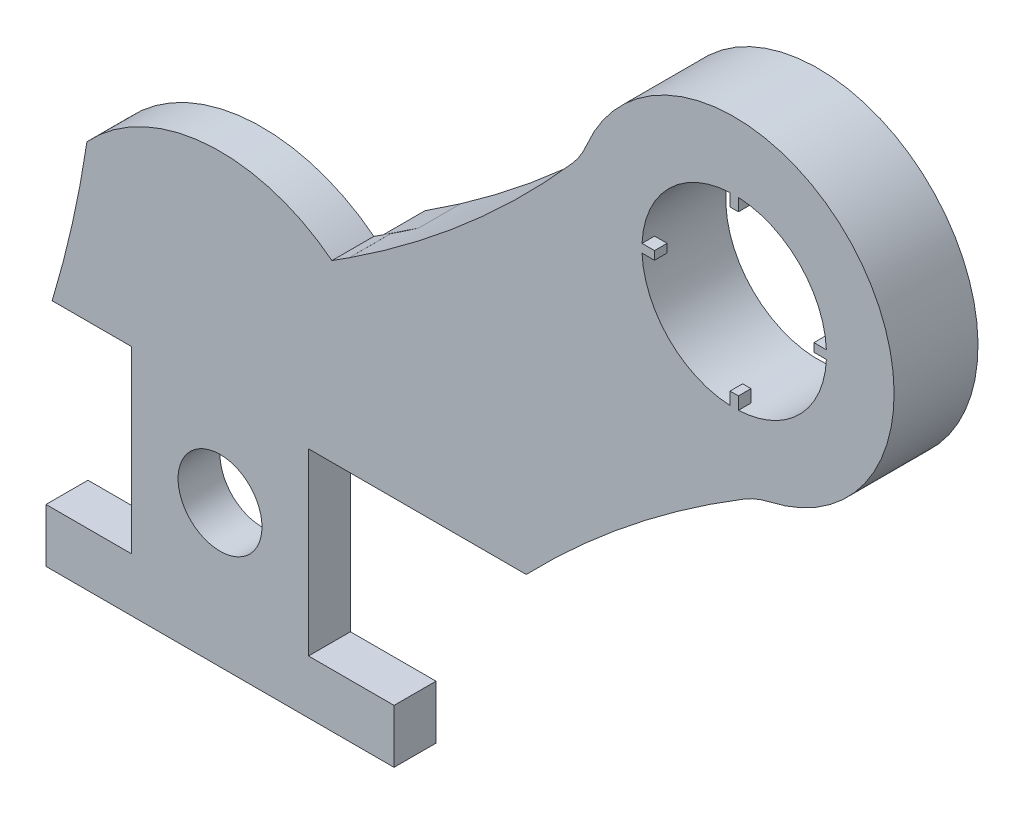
ISO-10303-21;
HEADER;
FILE_DESCRIPTION(('STEP AP214'),'2;1');
FILE_NAME('part.step','',(''),(''),'','','');
FILE_SCHEMA(('AUTOMOTIVE_DESIGN { 1 0 10303 214 1 1 1 1 }'));
ENDSEC;
DATA;
#1=APPLICATION_CONTEXT('core data for automotive mechanical design processes');
#2=APPLICATION_PROTOCOL_DEFINITION('international standard','automotive_design',2000,#1);
#3=PRODUCT_CONTEXT('',#1,'mechanical');
#4=PRODUCT('Part','Part','',(#3));
#5=PRODUCT_RELATED_PRODUCT_CATEGORY('part','',(#4));
#6=PRODUCT_DEFINITION_FORMATION('','',#4);
#7=PRODUCT_DEFINITION_CONTEXT('part definition',#1,'design');
#8=PRODUCT_DEFINITION('design','',#6,#7);
#9=PRODUCT_DEFINITION_SHAPE('','',#8);
#10=(LENGTH_UNIT() NAMED_UNIT(*) SI_UNIT(.MILLI.,.METRE.));
#11=(NAMED_UNIT(*) PLANE_ANGLE_UNIT() SI_UNIT($,.RADIAN.));
#12=(NAMED_UNIT(*) SI_UNIT($,.STERADIAN.) SOLID_ANGLE_UNIT());
#13=UNCERTAINTY_MEASURE_WITH_UNIT(LENGTH_MEASURE(1.E-05),#10,'distance_accuracy_value','');
#14=(GEOMETRIC_REPRESENTATION_CONTEXT(3) GLOBAL_UNCERTAINTY_ASSIGNED_CONTEXT((#13)) GLOBAL_UNIT_ASSIGNED_CONTEXT((#10,
#11,#12)) REPRESENTATION_CONTEXT('',''));
#15=CARTESIAN_POINT('',(0.,0.,0.));
#16=DIRECTION('',(0.,0.,1.));
#17=DIRECTION('',(1.,0.,0.));
#18=AXIS2_PLACEMENT_3D('',#15,#16,#17);
#19=CARTESIAN_POINT('',(61.2835554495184,51.423008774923,0.));
#20=DIRECTION('',(0.,0.,1.));
#21=DIRECTION('',(0.642787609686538,-0.766044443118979,0.));
#22=AXIS2_PLACEMENT_3D('',#19,#20,#21);
#23=CYLINDRICAL_SURFACE('',#22,11.);
#24=CARTESIAN_POINT('',(61.2835554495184,51.423008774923,0.));
#25=DIRECTION('',(0.,0.,1.));
#26=DIRECTION('',(0.642787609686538,-0.766044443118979,0.));
#27=AXIS2_PLACEMENT_3D('',#24,#25,#26);
#28=CIRCLE('',#27,11.);
#29=CARTESIAN_POINT('',(68.3542191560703,42.9965199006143,0.));
#30=VERTEX_POINT('',#29);
#31=EDGE_CURVE('E639',#30,#30,#28,.T.);
#32=ORIENTED_EDGE('',*,*,#31,.F.);
#33=EDGE_LOOP('',(#32));
#34=FACE_BOUND('',#33,.T.);
#35=DIRECTION('',(0.,0.,1.));
#36=VECTOR('',#35,1.);
#37=CARTESIAN_POINT('',(72.2721859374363,51.923008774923,0.));
#38=LINE('',#37,#36);
#39=CARTESIAN_POINT('',(72.2721859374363,51.923008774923,10.));
#40=VERTEX_POINT('',#39);
#41=CARTESIAN_POINT('',(72.2721859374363,51.923008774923,8.5));
#42=VERTEX_POINT('',#41);
#43=EDGE_CURVE('E297',#40,#42,#38,.F.);
#44=ORIENTED_EDGE('',*,*,#43,.F.);
#45=CARTESIAN_POINT('',(61.2835554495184,51.423008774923,10.));
#46=DIRECTION('',(0.,0.,1.));
#47=DIRECTION('',(0.642787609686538,-0.766044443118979,0.));
#48=AXIS2_PLACEMENT_3D('',#45,#46,#47);
#49=CIRCLE('',#48,11.);
#50=CARTESIAN_POINT('',(61.7835554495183,62.411639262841,10.));
#51=VERTEX_POINT('',#50);
#52=EDGE_CURVE('E632',#40,#51,#49,.T.);
#53=ORIENTED_EDGE('',*,*,#52,.T.);
#54=DIRECTION('',(0.,0.,1.));
#55=VECTOR('',#54,1.);
#56=CARTESIAN_POINT('',(61.7835554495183,62.411639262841,0.));
#57=LINE('',#56,#55);
#58=CARTESIAN_POINT('',(61.7835554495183,62.411639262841,8.5));
#59=VERTEX_POINT('',#58);
#60=EDGE_CURVE('E340',#59,#51,#57,.T.);
#61=ORIENTED_EDGE('',*,*,#60,.F.);
#62=CARTESIAN_POINT('',(61.2835554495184,51.423008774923,8.5));
#63=DIRECTION('',(0.,0.,-1.));
#64=DIRECTION('',(-1.,0.,0.));
#65=AXIS2_PLACEMENT_3D('',#62,#63,#64);
#66=CIRCLE('',#65,11.);
#67=CARTESIAN_POINT('',(60.7835554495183,62.411639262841,8.5));
#68=VERTEX_POINT('',#67);
#69=EDGE_CURVE('E44',#59,#68,#66,.F.);
#70=ORIENTED_EDGE('',*,*,#69,.T.);
#71=DIRECTION('',(0.,0.,1.));
#72=VECTOR('',#71,1.);
#73=CARTESIAN_POINT('',(60.7835554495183,62.411639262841,0.));
#74=LINE('',#73,#72);
#75=CARTESIAN_POINT('',(60.7835554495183,62.411639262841,10.));
#76=VERTEX_POINT('',#75);
#77=EDGE_CURVE('E343',#76,#68,#74,.F.);
#78=ORIENTED_EDGE('',*,*,#77,.F.);
#79=CARTESIAN_POINT('',(50.2949249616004,51.923008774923,10.));
#80=VERTEX_POINT('',#79);
#81=EDGE_CURVE('E630',#76,#80,#49,.T.);
#82=ORIENTED_EDGE('',*,*,#81,.T.);
#83=DIRECTION('',(0.,0.,1.));
#84=VECTOR('',#83,1.);
#85=CARTESIAN_POINT('',(50.2949249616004,51.923008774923,0.));
#86=LINE('',#85,#84);
#87=CARTESIAN_POINT('',(50.2949249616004,51.923008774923,8.5));
#88=VERTEX_POINT('',#87);
#89=EDGE_CURVE('E369',#88,#80,#86,.T.);
#90=ORIENTED_EDGE('',*,*,#89,.F.);
#91=CARTESIAN_POINT('',(61.2835554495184,51.423008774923,8.5));
#92=DIRECTION('',(0.,0.,1.));
#93=DIRECTION('',(1.,0.,0.));
#94=AXIS2_PLACEMENT_3D('',#91,#92,#93);
#95=CIRCLE('',#94,11.);
#96=CARTESIAN_POINT('',(50.2949249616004,50.923008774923,8.5));
#97=VERTEX_POINT('',#96);
#98=EDGE_CURVE('E610',#97,#88,#95,.F.);
#99=ORIENTED_EDGE('',*,*,#98,.F.);
#100=DIRECTION('',(0.,0.,1.));
#101=VECTOR('',#100,1.);
#102=CARTESIAN_POINT('',(50.2949249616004,50.923008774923,0.));
#103=LINE('',#102,#101);
#104=CARTESIAN_POINT('',(50.2949249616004,50.923008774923,10.));
#105=VERTEX_POINT('',#104);
#106=EDGE_CURVE('E366',#105,#97,#103,.F.);
#107=ORIENTED_EDGE('',*,*,#106,.F.);
#108=CARTESIAN_POINT('',(60.7835554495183,40.4343782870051,10.));
#109=VERTEX_POINT('',#108);
#110=EDGE_CURVE('E633',#105,#109,#49,.T.);
#111=ORIENTED_EDGE('',*,*,#110,.T.);
#112=DIRECTION('',(0.,0.,1.));
#113=VECTOR('',#112,1.);
#114=CARTESIAN_POINT('',(60.7835554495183,40.4343782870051,0.));
#115=LINE('',#114,#113);
#116=CARTESIAN_POINT('',(60.7835554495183,40.4343782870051,8.5));
#117=VERTEX_POINT('',#116);
#118=EDGE_CURVE('E607',#117,#109,#115,.T.);
#119=ORIENTED_EDGE('',*,*,#118,.F.);
#120=CARTESIAN_POINT('',(61.2835554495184,51.423008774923,8.5));
#121=DIRECTION('',(0.,0.,1.));
#122=DIRECTION('',(1.,0.,0.));
#123=AXIS2_PLACEMENT_3D('',#120,#121,#122);
#124=CIRCLE('',#123,11.);
#125=CARTESIAN_POINT('',(61.7835554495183,40.4343782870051,8.5));
#126=VERTEX_POINT('',#125);
#127=EDGE_CURVE('E600',#126,#117,#124,.F.);
#128=ORIENTED_EDGE('',*,*,#127,.F.);
#129=DIRECTION('',(0.,0.,1.));
#130=VECTOR('',#129,1.);
#131=CARTESIAN_POINT('',(61.7835554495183,40.4343782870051,0.));
#132=LINE('',#131,#130);
#133=CARTESIAN_POINT('',(61.7835554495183,40.4343782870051,10.));
#134=VERTEX_POINT('',#133);
#135=EDGE_CURVE('E603',#134,#126,#132,.F.);
#136=ORIENTED_EDGE('',*,*,#135,.F.);
#137=CARTESIAN_POINT('',(72.2721859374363,50.923008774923,10.));
#138=VERTEX_POINT('',#137);
#139=EDGE_CURVE('E635',#134,#138,#49,.T.);
#140=ORIENTED_EDGE('',*,*,#139,.T.);
#141=DIRECTION('',(0.,0.,1.));
#142=VECTOR('',#141,1.);
#143=CARTESIAN_POINT('',(72.2721859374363,50.923008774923,0.));
#144=LINE('',#143,#142);
#145=CARTESIAN_POINT('',(72.2721859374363,50.923008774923,8.5));
#146=VERTEX_POINT('',#145);
#147=EDGE_CURVE('E51',#146,#138,#144,.T.);
#148=ORIENTED_EDGE('',*,*,#147,.F.);
#149=CARTESIAN_POINT('',(61.2835554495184,51.423008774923,8.5));
#150=DIRECTION('',(0.,0.,1.));
#151=DIRECTION('',(1.,0.,0.));
#152=AXIS2_PLACEMENT_3D('',#149,#150,#151);
#153=CIRCLE('',#152,11.);
#154=EDGE_CURVE('E11',#42,#146,#153,.F.);
#155=ORIENTED_EDGE('',*,*,#154,.F.);
#156=EDGE_LOOP('',(#44,#53,#61,#70,#78,#82,#90,#99,#107,#111,#119,#128,#136,#140,#148,#155));
#157=FACE_BOUND('',#156,.T.);
#158=ADVANCED_FACE('F36',(#34,#157),#23,.F.);
#159=CARTESIAN_POINT('',(-55.8578127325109,142.061134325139,10.));
#160=DIRECTION('',(0.,0.,-1.));
#161=DIRECTION('',(-0.642787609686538,0.766044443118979,0.));
#162=AXIS2_PLACEMENT_3D('',#159,#160,#161);
#163=CYLINDRICAL_SURFACE('',#162,130.287303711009);
#164=DIRECTION('',(0.,0.,-1.));
#165=VECTOR('',#164,1.);
#166=CARTESIAN_POINT('',(15.3744354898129,32.9705833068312,7.5));
#167=LINE('',#166,#165);
#168=CARTESIAN_POINT('',(15.3744354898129,32.9705833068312,10.));
#169=VERTEX_POINT('',#168);
#170=CARTESIAN_POINT('',(15.3744354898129,32.9705833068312,5.));
#171=VERTEX_POINT('',#170);
#172=EDGE_CURVE('E463',#169,#171,#167,.T.);
#173=ORIENTED_EDGE('',*,*,#172,.F.);
#174=CARTESIAN_POINT('',(-55.8578127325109,142.061134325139,10.));
#175=DIRECTION('',(0.,0.,-1.));
#176=DIRECTION('',(0.642787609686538,-0.766044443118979,0.));
#177=AXIS2_PLACEMENT_3D('',#174,#175,#176);
#178=CIRCLE('',#177,130.287303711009);
#179=CARTESIAN_POINT('',(41.9819853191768,56.0253544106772,10.));
#180=VERTEX_POINT('',#179);
#181=EDGE_CURVE('E651',#180,#169,#178,.T.);
#182=ORIENTED_EDGE('',*,*,#181,.F.);
#183=DIRECTION('',(0.,0.,-1.));
#184=VECTOR('',#183,1.);
#185=CARTESIAN_POINT('',(41.9819853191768,56.0253544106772,10.));
#186=LINE('',#185,#184);
#187=CARTESIAN_POINT('',(41.9819853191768,56.0253544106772,0.));
#188=VERTEX_POINT('',#187);
#189=EDGE_CURVE('E673',#180,#188,#186,.T.);
#190=ORIENTED_EDGE('',*,*,#189,.T.);
#191=CARTESIAN_POINT('',(-55.8578127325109,142.061134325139,0.));
#192=DIRECTION('',(0.,0.,-1.));
#193=DIRECTION('',(0.642787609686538,-0.766044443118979,0.));
#194=AXIS2_PLACEMENT_3D('',#191,#192,#193);
#195=CIRCLE('',#194,130.287303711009);
#196=CARTESIAN_POINT('',(18.6719070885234,35.1962552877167,0.));
#197=VERTEX_POINT('',#196);
#198=EDGE_CURVE('E660',#188,#197,#195,.T.);
#199=ORIENTED_EDGE('',*,*,#198,.T.);
#200=DIRECTION('',(0.,0.,-1.));
#201=VECTOR('',#200,1.);
#202=CARTESIAN_POINT('',(18.6719070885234,35.1962552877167,5.));
#203=LINE('',#202,#201);
#204=CARTESIAN_POINT('',(18.6719070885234,35.1962552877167,5.));
#205=VERTEX_POINT('',#204);
#206=EDGE_CURVE('E502',#205,#197,#203,.T.);
#207=ORIENTED_EDGE('',*,*,#206,.F.);
#208=CARTESIAN_POINT('',(-55.8578127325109,142.061134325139,5.));
#209=DIRECTION('',(0.,0.,1.));
#210=DIRECTION('',(1.,0.,0.));
#211=AXIS2_PLACEMENT_3D('',#208,#209,#210);
#212=CIRCLE('',#211,130.287303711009);
#213=EDGE_CURVE('E482',#205,#171,#212,.F.);
#214=ORIENTED_EDGE('',*,*,#213,.T.);
#215=EDGE_LOOP('',(#173,#182,#190,#199,#207,#214));
#216=FACE_BOUND('',#215,.T.);
#217=ADVANCED_FACE('F554',(#216),#163,.F.);
#218=CARTESIAN_POINT('',(-2.94073191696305,16.5008121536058,5.));
#219=DIRECTION('',(0.,0.,1.));
#220=DIRECTION('',(1.,0.,0.));
#221=AXIS2_PLACEMENT_3D('',#218,#219,#220);
#222=PLANE('',#221);
#223=DIRECTION('',(-0.841485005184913,-0.540280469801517,0.));
#224=VECTOR('',#223,1.);
#225=CARTESIAN_POINT('',(141.821360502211,114.161180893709,5.));
#226=LINE('',#225,#224);
#227=CARTESIAN_POINT('',(15.3739226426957,32.9748487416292,5.));
#228=VERTEX_POINT('',#227);
#229=CARTESIAN_POINT('',(14.7588438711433,32.5799337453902,5.));
#230=VERTEX_POINT('',#229);
#231=EDGE_CURVE('E461',#228,#230,#226,.T.);
#232=ORIENTED_EDGE('',*,*,#231,.F.);
#233=CARTESIAN_POINT('',(144.7298524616,48.5255699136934,5.));
#234=DIRECTION('',(0.,0.,-1.));
#235=DIRECTION('',(-1.,0.,0.));
#236=AXIS2_PLACEMENT_3D('',#233,#234,#235);
#237=CIRCLE('',#236,130.287303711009);
#238=EDGE_CURVE('E415',#228,#171,#237,.F.);
#239=ORIENTED_EDGE('',*,*,#238,.T.);
#240=ORIENTED_EDGE('',*,*,#213,.F.);
#241=DIRECTION('',(0.831303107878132,0.555819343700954,0.));
#242=VECTOR('',#241,1.);
#243=CARTESIAN_POINT('',(14.4169307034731,32.351326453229,5.));
#244=LINE('',#243,#242);
#245=EDGE_CURVE('E470',#230,#205,#244,.T.);
#246=ORIENTED_EDGE('',*,*,#245,.F.);
#247=EDGE_LOOP('',(#232,#239,#240,#246));
#248=FACE_BOUND('',#247,.T.);
#249=ADVANCED_FACE('F558',(#248),#222,.T.);
#250=CARTESIAN_POINT('',(158.293751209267,-100.510405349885,5.));
#251=DIRECTION('',(0.,0.,-1.));
#252=DIRECTION('',(-0.642787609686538,0.766044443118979,0.));
#253=AXIS2_PLACEMENT_3D('',#250,#251,#252);
#254=PLANE('',#253);
#255=DIRECTION('',(0.,-1.,0.));
#256=VECTOR('',#255,1.);
#257=CARTESIAN_POINT('',(20.741205,-16.9424449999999,5.));
#258=LINE('',#257,#256);
#259=CARTESIAN_POINT('',(20.741205,-10.5428949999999,5.));
#260=VERTEX_POINT('',#259);
#261=CARTESIAN_POINT('',(20.741205,-16.9424449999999,5.));
#262=VERTEX_POINT('',#261);
#263=EDGE_CURVE('E407',#260,#262,#258,.T.);
#264=ORIENTED_EDGE('',*,*,#263,.T.);
#265=DIRECTION('',(1.,0.,0.));
#266=VECTOR('',#265,1.);
#267=CARTESIAN_POINT('',(158.293751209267,-16.9424449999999,5.));
#268=LINE('',#267,#266);
#269=CARTESIAN_POINT('',(-20.741205,-16.942445,5.));
#270=VERTEX_POINT('',#269);
#271=EDGE_CURVE('E686',#270,#262,#268,.T.);
#272=ORIENTED_EDGE('',*,*,#271,.F.);
#273=DIRECTION('',(0.,1.,0.));
#274=VECTOR('',#273,1.);
#275=CARTESIAN_POINT('',(-20.741205,-10.5428949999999,5.));
#276=LINE('',#275,#274);
#277=CARTESIAN_POINT('',(-20.741205,-10.5428949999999,5.));
#278=VERTEX_POINT('',#277);
#279=EDGE_CURVE('E410',#270,#278,#276,.T.);
#280=ORIENTED_EDGE('',*,*,#279,.T.);
#281=DIRECTION('',(-1.,0.,0.));
#282=VECTOR('',#281,1.);
#283=CARTESIAN_POINT('',(158.293751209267,-10.542895,5.));
#284=LINE('',#283,#282);
#285=CARTESIAN_POINT('',(-10.542895,-10.542895,5.));
#286=VERTEX_POINT('',#285);
#287=EDGE_CURVE('E688',#286,#278,#284,.T.);
#288=ORIENTED_EDGE('',*,*,#287,.F.);
#289=DIRECTION('',(0.,-1.,0.));
#290=VECTOR('',#289,1.);
#291=CARTESIAN_POINT('',(-10.542895,-100.510405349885,5.));
#292=LINE('',#291,#290);
#293=CARTESIAN_POINT('',(-10.542895,10.845815,5.));
#294=VERTEX_POINT('',#293);
#295=EDGE_CURVE('E604',#294,#286,#292,.T.);
#296=ORIENTED_EDGE('',*,*,#295,.F.);
#297=DIRECTION('',(-1.,0.,0.));
#298=VECTOR('',#297,1.);
#299=CARTESIAN_POINT('',(-20.9931970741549,10.845815,5.));
#300=LINE('',#299,#298);
#301=CARTESIAN_POINT('',(-20.0100962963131,10.845815,5.));
#302=VERTEX_POINT('',#301);
#303=EDGE_CURVE('E413',#294,#302,#300,.T.);
#304=ORIENTED_EDGE('',*,*,#303,.T.);
#305=CARTESIAN_POINT('',(-144.7298524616,48.5255699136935,5.));
#306=DIRECTION('',(0.,0.,-1.));
#307=DIRECTION('',(-1.,0.,0.));
#308=AXIS2_PLACEMENT_3D('',#305,#306,#307);
#309=CIRCLE('',#308,130.287303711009);
#310=CARTESIAN_POINT('',(-15.8639375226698,29.332928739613,5.));
#311=VERTEX_POINT('',#310);
#312=EDGE_CURVE('E418',#302,#311,#309,.F.);
#313=ORIENTED_EDGE('',*,*,#312,.T.);
#314=CARTESIAN_POINT('',(0.,14.6895133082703,5.));
#315=DIRECTION('',(0.,0.,-1.));
#316=DIRECTION('',(-1.,0.,0.));
#317=AXIS2_PLACEMENT_3D('',#314,#315,#316);
#318=CIRCLE('',#317,21.5892132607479);
#319=CARTESIAN_POINT('',(13.3366384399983,31.666798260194,5.));
#320=VERTEX_POINT('',#319);
#321=EDGE_CURVE('E457',#311,#320,#318,.T.);
#322=ORIENTED_EDGE('',*,*,#321,.T.);
#323=EDGE_CURVE('E460',#230,#320,#226,.T.);
#324=ORIENTED_EDGE('',*,*,#323,.F.);
#325=CARTESIAN_POINT('',(14.4169307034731,32.3513264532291,5.));
#326=VERTEX_POINT('',#325);
#327=EDGE_CURVE('E466',#326,#230,#244,.T.);
#328=ORIENTED_EDGE('',*,*,#327,.F.);
#329=CARTESIAN_POINT('',(-2.94073191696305,16.5008121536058,5.));
#330=DIRECTION('',(0.,0.,1.));
#331=DIRECTION('',(1.,0.,0.));
#332=AXIS2_PLACEMENT_3D('',#329,#330,#331);
#333=CIRCLE('',#332,23.5058983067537);
#334=CARTESIAN_POINT('',(19.8617514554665,22.2081764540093,5.));
#335=VERTEX_POINT('',#334);
#336=EDGE_CURVE('E471',#335,#326,#333,.T.);
#337=ORIENTED_EDGE('',*,*,#336,.F.);
#338=DIRECTION('',(-0.242805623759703,0.970074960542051,0.));
#339=VECTOR('',#338,1.);
#340=CARTESIAN_POINT('',(22.7057020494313,10.845815,5.));
#341=LINE('',#340,#339);
#342=CARTESIAN_POINT('',(22.7057020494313,10.8458150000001,5.));
#343=VERTEX_POINT('',#342);
#344=EDGE_CURVE('E475',#343,#335,#341,.T.);
#345=ORIENTED_EDGE('',*,*,#344,.F.);
#346=DIRECTION('',(1.,0.,0.));
#347=VECTOR('',#346,1.);
#348=CARTESIAN_POINT('',(158.293751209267,10.845815,5.));
#349=LINE('',#348,#347);
#350=CARTESIAN_POINT('',(10.542895,10.845815,5.));
#351=VERTEX_POINT('',#350);
#352=EDGE_CURVE('E684',#351,#343,#349,.T.);
#353=ORIENTED_EDGE('',*,*,#352,.F.);
#354=DIRECTION('',(0.,1.,0.));
#355=VECTOR('',#354,1.);
#356=CARTESIAN_POINT('',(10.542895,-100.510405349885,5.));
#357=LINE('',#356,#355);
#358=CARTESIAN_POINT('',(10.542895,-10.5428949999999,5.));
#359=VERTEX_POINT('',#358);
#360=EDGE_CURVE('E682',#359,#351,#357,.T.);
#361=ORIENTED_EDGE('',*,*,#360,.F.);
#362=DIRECTION('',(1.,0.,0.));
#363=VECTOR('',#362,1.);
#364=CARTESIAN_POINT('',(20.741205,-10.5428949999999,5.));
#365=LINE('',#364,#363);
#366=EDGE_CURVE('E405',#359,#260,#365,.T.);
#367=ORIENTED_EDGE('',*,*,#366,.T.);
#368=EDGE_LOOP('',(#264,#272,#280,#288,#296,#304,#313,#322,#324,#328,#337,#345,#353,#361,#367));
#369=FACE_BOUND('',#368,.T.);
#370=CARTESIAN_POINT('',(0.,0.,5.));
#371=DIRECTION('',(0.,0.,-1.));
#372=DIRECTION('',(-0.642787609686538,0.766044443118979,0.));
#373=AXIS2_PLACEMENT_3D('',#370,#371,#372);
#374=CIRCLE('',#373,5.);
#375=CARTESIAN_POINT('',(-3.21393804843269,3.8302222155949,5.));
#376=VERTEX_POINT('',#375);
#377=EDGE_CURVE('E641',#376,#376,#374,.F.);
#378=ORIENTED_EDGE('',*,*,#377,.T.);
#379=EDGE_LOOP('',(#378));
#380=FACE_BOUND('',#379,.T.);
#381=ADVANCED_FACE('F547',(#369,#380),#254,.T.);
#382=CARTESIAN_POINT('',(10.542895,10.845815,10.));
#383=DIRECTION('',(0.,1.,0.));
#384=DIRECTION('',(0.,0.,1.));
#385=AXIS2_PLACEMENT_3D('',#382,#383,#384);
#386=PLANE('',#385);
#387=ORIENTED_EDGE('',*,*,#352,.T.);
#388=DIRECTION('',(0.,0.,1.));
#389=VECTOR('',#388,1.);
#390=CARTESIAN_POINT('',(22.7057020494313,10.845815,-33.5460682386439));
#391=LINE('',#390,#389);
#392=CARTESIAN_POINT('',(22.7057020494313,10.845815,0.));
#393=VERTEX_POINT('',#392);
#394=EDGE_CURVE('E478',#393,#343,#391,.T.);
#395=ORIENTED_EDGE('',*,*,#394,.F.);
#396=DIRECTION('',(-1.,0.,0.));
#397=VECTOR('',#396,1.);
#398=CARTESIAN_POINT('',(36.5003374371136,10.845815,0.));
#399=LINE('',#398,#397);
#400=CARTESIAN_POINT('',(36.5003374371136,10.845815,0.));
#401=VERTEX_POINT('',#400);
#402=EDGE_CURVE('E486',#401,#393,#399,.T.);
#403=ORIENTED_EDGE('',*,*,#402,.F.);
#404=DIRECTION('',(0.,0.,1.));
#405=VECTOR('',#404,1.);
#406=CARTESIAN_POINT('',(36.5003374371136,10.845815,-33.5460682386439));
#407=LINE('',#406,#405);
#408=CARTESIAN_POINT('',(36.5003374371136,10.845815,5.));
#409=VERTEX_POINT('',#408);
#410=EDGE_CURVE('E465',#401,#409,#407,.T.);
#411=ORIENTED_EDGE('',*,*,#410,.T.);
#412=DIRECTION('',(0.,0.,-1.));
#413=VECTOR('',#412,1.);
#414=CARTESIAN_POINT('',(36.5003374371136,10.845815,10.));
#415=LINE('',#414,#413);
#416=CARTESIAN_POINT('',(36.5003374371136,10.845815,10.));
#417=VERTEX_POINT('',#416);
#418=EDGE_CURVE('E595',#417,#409,#415,.T.);
#419=ORIENTED_EDGE('',*,*,#418,.F.);
#420=DIRECTION('',(1.,0.,0.));
#421=VECTOR('',#420,1.);
#422=CARTESIAN_POINT('',(10.542895,10.845815,10.));
#423=LINE('',#422,#421);
#424=CARTESIAN_POINT('',(10.542895,10.845815,10.));
#425=VERTEX_POINT('',#424);
#426=EDGE_CURVE('E707',#425,#417,#423,.T.);
#427=ORIENTED_EDGE('',*,*,#426,.F.);
#428=DIRECTION('',(0.,0.,-1.));
#429=VECTOR('',#428,1.);
#430=CARTESIAN_POINT('',(10.542895,10.845815,10.));
#431=LINE('',#430,#429);
#432=EDGE_CURVE('E705',#425,#351,#431,.T.);
#433=ORIENTED_EDGE('',*,*,#432,.T.);
#434=EDGE_LOOP('',(#387,#395,#403,#411,#419,#427,#433));
#435=FACE_BOUND('',#434,.T.);
#436=ADVANCED_FACE('F543',(#435),#386,.F.);
#437=CARTESIAN_POINT('',(0.,0.,0.));
#438=DIRECTION('',(0.,0.,1.));
#439=DIRECTION('',(0.642787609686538,-0.766044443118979,0.));
#440=AXIS2_PLACEMENT_3D('',#437,#438,#439);
#441=CYLINDRICAL_SURFACE('',#440,5.);
#442=CARTESIAN_POINT('',(0.,0.,10.));
#443=DIRECTION('',(0.,0.,1.));
#444=DIRECTION('',(0.642787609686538,-0.766044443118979,0.));
#445=AXIS2_PLACEMENT_3D('',#442,#443,#444);
#446=CIRCLE('',#445,5.);
#447=CARTESIAN_POINT('',(3.21393804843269,-3.8302222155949,10.));
#448=VERTEX_POINT('',#447);
#449=EDGE_CURVE('E644',#448,#448,#446,.T.);
#450=ORIENTED_EDGE('',*,*,#449,.T.);
#451=EDGE_LOOP('',(#450));
#452=FACE_BOUND('',#451,.T.);
#453=ORIENTED_EDGE('',*,*,#377,.F.);
#454=EDGE_LOOP('',(#453));
#455=FACE_BOUND('',#454,.T.);
#456=ADVANCED_FACE('F546',(#452,#455),#441,.F.);
#457=CARTESIAN_POINT('',(61.2835554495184,51.423008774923,10.));
#458=DIRECTION('',(0.,0.,-1.));
#459=DIRECTION('',(-0.642787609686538,0.766044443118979,0.));
#460=AXIS2_PLACEMENT_3D('',#457,#458,#459);
#461=CYLINDRICAL_SURFACE('',#460,19.0586935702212);
#462=CARTESIAN_POINT('',(61.2835554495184,51.423008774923,0.));
#463=DIRECTION('',(0.,0.,1.));
#464=DIRECTION('',(-0.642787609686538,0.766044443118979,0.));
#465=AXIS2_PLACEMENT_3D('',#462,#463,#464);
#466=CIRCLE('',#465,19.0586935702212);
#467=CARTESIAN_POINT('',(65.4679630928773,32.8293396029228,0.));
#468=VERTEX_POINT('',#467);
#469=CARTESIAN_POINT('',(43.6989806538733,58.772602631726,0.));
#470=VERTEX_POINT('',#469);
#471=EDGE_CURVE('E647',#468,#470,#466,.T.);
#472=ORIENTED_EDGE('',*,*,#471,.T.);
#473=DIRECTION('',(0.,0.,-1.));
#474=VECTOR('',#473,1.);
#475=CARTESIAN_POINT('',(43.6989806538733,58.772602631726,10.));
#476=LINE('',#475,#474);
#477=CARTESIAN_POINT('',(43.6989806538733,58.772602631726,10.));
#478=VERTEX_POINT('',#477);
#479=EDGE_CURVE('E676',#470,#478,#476,.F.);
#480=ORIENTED_EDGE('',*,*,#479,.T.);
#481=CARTESIAN_POINT('',(61.2835554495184,51.423008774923,10.));
#482=DIRECTION('',(0.,0.,1.));
#483=DIRECTION('',(-0.642787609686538,0.766044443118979,0.));
#484=AXIS2_PLACEMENT_3D('',#481,#482,#483);
#485=CIRCLE('',#484,19.0586935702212);
#486=CARTESIAN_POINT('',(65.4679630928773,32.8293396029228,10.));
#487=VERTEX_POINT('',#486);
#488=EDGE_CURVE('E648',#487,#478,#485,.T.);
#489=ORIENTED_EDGE('',*,*,#488,.F.);
#490=DIRECTION('',(0.,0.,-1.));
#491=VECTOR('',#490,1.);
#492=CARTESIAN_POINT('',(65.4679630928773,32.8293396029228,10.));
#493=LINE('',#492,#491);
#494=EDGE_CURVE('E657',#487,#468,#493,.T.);
#495=ORIENTED_EDGE('',*,*,#494,.T.);
#496=EDGE_LOOP('',(#472,#480,#489,#495));
#497=FACE_BOUND('',#496,.T.);
#498=ADVANCED_FACE('F562',(#497),#461,.T.);
#499=CARTESIAN_POINT('',(130.203299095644,-79.6778641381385,10.));
#500=DIRECTION('',(0.,0.,-1.));
#501=DIRECTION('',(-0.642787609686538,0.766044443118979,0.));
#502=AXIS2_PLACEMENT_3D('',#499,#500,#501);
#503=CYLINDRICAL_SURFACE('',#502,130.287303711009);
#504=CARTESIAN_POINT('',(37.4906116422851,11.8597734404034,5.));
#505=DIRECTION('',(-0.698702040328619,-0.715412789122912,0.));
#506=VECTOR('',#505,1.);
#507=LINE('',#504,#506);
#508=CARTESIAN_POINT('',(37.4906116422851,11.8597734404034,5.));
#509=VERTEX_POINT('',#508);
#510=EDGE_CURVE('E512',#509,#409,#507,.T.);
#511=ORIENTED_EDGE('',*,*,#510,.F.);
#512=DIRECTION('',(0.,0.,-1.));
#513=VECTOR('',#512,1.);
#514=CARTESIAN_POINT('',(37.4906116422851,11.8597734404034,5.));
#515=LINE('',#514,#513);
#516=CARTESIAN_POINT('',(37.4906116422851,11.8597734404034,0.));
#517=VERTEX_POINT('',#516);
#518=EDGE_CURVE('E585',#509,#517,#515,.T.);
#519=ORIENTED_EDGE('',*,*,#518,.T.);
#520=CARTESIAN_POINT('',(130.203299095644,-79.6778641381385,0.));
#521=DIRECTION('',(0.,0.,-1.));
#522=DIRECTION('',(-0.642787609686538,0.766044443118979,0.));
#523=AXIS2_PLACEMENT_3D('',#520,#521,#522);
#524=CIRCLE('',#523,130.287303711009);
#525=CARTESIAN_POINT('',(62.4642986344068,31.6154839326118,0.));
#526=VERTEX_POINT('',#525);
#527=EDGE_CURVE('E652',#517,#526,#524,.T.);
#528=ORIENTED_EDGE('',*,*,#527,.T.);
#529=DIRECTION('',(0.,0.,-1.));
#530=VECTOR('',#529,1.);
#531=CARTESIAN_POINT('',(62.4642986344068,31.6154839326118,10.));
#532=LINE('',#531,#530);
#533=CARTESIAN_POINT('',(62.4642986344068,31.6154839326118,10.));
#534=VERTEX_POINT('',#533);
#535=EDGE_CURVE('E665',#526,#534,#532,.F.);
#536=ORIENTED_EDGE('',*,*,#535,.T.);
#537=CARTESIAN_POINT('',(130.203299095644,-79.6778641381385,10.));
#538=DIRECTION('',(0.,0.,-1.));
#539=DIRECTION('',(-0.642787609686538,0.766044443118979,0.));
#540=AXIS2_PLACEMENT_3D('',#537,#538,#539);
#541=CIRCLE('',#540,130.287303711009);
#542=EDGE_CURVE('E655',#417,#534,#541,.T.);
#543=ORIENTED_EDGE('',*,*,#542,.F.);
#544=ORIENTED_EDGE('',*,*,#418,.T.);
#545=EDGE_LOOP('',(#511,#519,#528,#536,#543,#544));
#546=FACE_BOUND('',#545,.T.);
#547=ADVANCED_FACE('F568',(#546),#503,.F.);
#548=CARTESIAN_POINT('',(95.743427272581,-14.1274276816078,10.));
#549=DIRECTION('',(0.,0.,-1.));
#550=DIRECTION('',(-0.642787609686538,0.766044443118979,0.));
#551=AXIS2_PLACEMENT_3D('',#548,#549,#550);
#552=PLANE('',#551);
#553=ORIENTED_EDGE('',*,*,#52,.F.);
#554=DIRECTION('',(1.,0.,0.));
#555=VECTOR('',#554,1.);
#556=CARTESIAN_POINT('',(73.7835554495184,51.923008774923,10.));
#557=LINE('',#556,#555);
#558=CARTESIAN_POINT('',(70.7835554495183,51.923008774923,10.));
#559=VERTEX_POINT('',#558);
#560=EDGE_CURVE('E1147',#559,#40,#557,.T.);
#561=ORIENTED_EDGE('',*,*,#560,.F.);
#562=DIRECTION('',(0.,1.,0.));
#563=VECTOR('',#562,1.);
#564=CARTESIAN_POINT('',(70.7835554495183,50.923008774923,10.));
#565=LINE('',#564,#563);
#566=CARTESIAN_POINT('',(70.7835554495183,50.923008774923,10.));
#567=VERTEX_POINT('',#566);
#568=EDGE_CURVE('E312',#567,#559,#565,.T.);
#569=ORIENTED_EDGE('',*,*,#568,.F.);
#570=DIRECTION('',(-1.,0.,0.));
#571=VECTOR('',#570,1.);
#572=CARTESIAN_POINT('',(73.7835554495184,50.923008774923,10.));
#573=LINE('',#572,#571);
#574=EDGE_CURVE('E308',#138,#567,#573,.T.);
#575=ORIENTED_EDGE('',*,*,#574,.F.);
#576=ORIENTED_EDGE('',*,*,#139,.F.);
#577=DIRECTION('',(0.,-1.,0.));
#578=VECTOR('',#577,1.);
#579=CARTESIAN_POINT('',(61.7835554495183,38.923008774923,10.));
#580=LINE('',#579,#578);
#581=CARTESIAN_POINT('',(61.7835554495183,41.923008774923,10.));
#582=VERTEX_POINT('',#581);
#583=EDGE_CURVE('E376',#582,#134,#580,.T.);
#584=ORIENTED_EDGE('',*,*,#583,.F.);
#585=DIRECTION('',(1.,0.,0.));
#586=VECTOR('',#585,1.);
#587=CARTESIAN_POINT('',(61.7835554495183,41.923008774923,10.));
#588=LINE('',#587,#586);
#589=CARTESIAN_POINT('',(60.7835554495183,41.923008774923,10.));
#590=VERTEX_POINT('',#589);
#591=EDGE_CURVE('E383',#590,#582,#588,.T.);
#592=ORIENTED_EDGE('',*,*,#591,.F.);
#593=DIRECTION('',(0.,1.,0.));
#594=VECTOR('',#593,1.);
#595=CARTESIAN_POINT('',(60.7835554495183,38.923008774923,10.));
#596=LINE('',#595,#594);
#597=EDGE_CURVE('E372',#109,#590,#596,.T.);
#598=ORIENTED_EDGE('',*,*,#597,.F.);
#599=ORIENTED_EDGE('',*,*,#110,.F.);
#600=DIRECTION('',(-1.,0.,0.));
#601=VECTOR('',#600,1.);
#602=CARTESIAN_POINT('',(51.7835554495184,50.923008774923,10.));
#603=LINE('',#602,#601);
#604=CARTESIAN_POINT('',(51.7835554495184,50.923008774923,10.));
#605=VERTEX_POINT('',#604);
#606=EDGE_CURVE('E350',#605,#105,#603,.T.);
#607=ORIENTED_EDGE('',*,*,#606,.F.);
#608=DIRECTION('',(0.,-1.,0.));
#609=VECTOR('',#608,1.);
#610=CARTESIAN_POINT('',(51.7835554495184,50.923008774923,10.));
#611=LINE('',#610,#609);
#612=CARTESIAN_POINT('',(51.7835554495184,51.923008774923,10.));
#613=VERTEX_POINT('',#612);
#614=EDGE_CURVE('E357',#613,#605,#611,.T.);
#615=ORIENTED_EDGE('',*,*,#614,.F.);
#616=DIRECTION('',(1.,0.,0.));
#617=VECTOR('',#616,1.);
#618=CARTESIAN_POINT('',(51.7835554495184,51.923008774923,10.));
#619=LINE('',#618,#617);
#620=EDGE_CURVE('E346',#80,#613,#619,.T.);
#621=ORIENTED_EDGE('',*,*,#620,.F.);
#622=ORIENTED_EDGE('',*,*,#81,.F.);
#623=DIRECTION('',(0.,1.,0.));
#624=VECTOR('',#623,1.);
#625=CARTESIAN_POINT('',(60.7835554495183,63.923008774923,10.));
#626=LINE('',#625,#624);
#627=CARTESIAN_POINT('',(60.7835554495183,60.923008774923,10.));
#628=VERTEX_POINT('',#627);
#629=EDGE_CURVE('E320',#628,#76,#626,.T.);
#630=ORIENTED_EDGE('',*,*,#629,.F.);
#631=DIRECTION('',(-1.,0.,0.));
#632=VECTOR('',#631,1.);
#633=CARTESIAN_POINT('',(61.7835554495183,60.923008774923,10.));
#634=LINE('',#633,#632);
#635=CARTESIAN_POINT('',(61.7835554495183,60.923008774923,10.));
#636=VERTEX_POINT('',#635);
#637=EDGE_CURVE('E325',#636,#628,#634,.T.);
#638=ORIENTED_EDGE('',*,*,#637,.F.);
#639=DIRECTION('',(0.,-1.,0.));
#640=VECTOR('',#639,1.);
#641=CARTESIAN_POINT('',(61.7835554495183,63.923008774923,10.));
#642=LINE('',#641,#640);
#643=EDGE_CURVE('E332',#51,#636,#642,.T.);
#644=ORIENTED_EDGE('',*,*,#643,.F.);
#645=EDGE_LOOP('',(#553,#561,#569,#575,#576,#584,#592,#598,#599,#607,#615,#621,#622,#630,#638,#644));
#646=FACE_BOUND('',#645,.T.);
#647=DIRECTION('',(1.,0.,0.));
#648=VECTOR('',#647,1.);
#649=CARTESIAN_POINT('',(8.24830739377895,-16.9424449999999,10.));
#650=LINE('',#649,#648);
#651=CARTESIAN_POINT('',(-20.741205,-16.942445,10.));
#652=VERTEX_POINT('',#651);
#653=CARTESIAN_POINT('',(20.741205,-16.9424449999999,10.));
#654=VERTEX_POINT('',#653);
#655=EDGE_CURVE('E703',#652,#654,#650,.T.);
#656=ORIENTED_EDGE('',*,*,#655,.T.);
#657=DIRECTION('',(0.,-1.,0.));
#658=VECTOR('',#657,1.);
#659=CARTESIAN_POINT('',(20.741205,-16.9424449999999,10.));
#660=LINE('',#659,#658);
#661=CARTESIAN_POINT('',(20.741205,-10.5428949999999,10.));
#662=VERTEX_POINT('',#661);
#663=EDGE_CURVE('E424',#662,#654,#660,.T.);
#664=ORIENTED_EDGE('',*,*,#663,.F.);
#665=DIRECTION('',(1.,0.,0.));
#666=VECTOR('',#665,1.);
#667=CARTESIAN_POINT('',(20.741205,-10.5428949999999,10.));
#668=LINE('',#667,#666);
#669=CARTESIAN_POINT('',(10.542895,-10.5428949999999,10.));
#670=VERTEX_POINT('',#669);
#671=EDGE_CURVE('E421',#670,#662,#668,.T.);
#672=ORIENTED_EDGE('',*,*,#671,.F.);
#673=DIRECTION('',(0.,1.,0.));
#674=VECTOR('',#673,1.);
#675=CARTESIAN_POINT('',(10.542895,-10.5428949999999,10.));
#676=LINE('',#675,#674);
#677=EDGE_CURVE('E597',#670,#425,#676,.T.);
#678=ORIENTED_EDGE('',*,*,#677,.T.);
#679=ORIENTED_EDGE('',*,*,#426,.T.);
#680=ORIENTED_EDGE('',*,*,#542,.T.);
#681=CARTESIAN_POINT('',(67.6635005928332,23.0733355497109,10.));
#682=DIRECTION('',(0.,0.,-1.));
#683=DIRECTION('',(-0.642787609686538,0.766044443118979,0.));
#684=AXIS2_PLACEMENT_3D('',#681,#682,#683);
#685=CIRCLE('',#684,10.);
#686=EDGE_CURVE('E671',#534,#487,#685,.T.);
#687=ORIENTED_EDGE('',*,*,#686,.T.);
#688=ORIENTED_EDGE('',*,*,#488,.T.);
#689=CARTESIAN_POINT('',(34.4724433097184,62.628897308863,10.));
#690=DIRECTION('',(0.,0.,-1.));
#691=DIRECTION('',(-0.642787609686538,0.766044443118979,0.));
#692=AXIS2_PLACEMENT_3D('',#689,#690,#691);
#693=CIRCLE('',#692,10.);
#694=EDGE_CURVE('E680',#478,#180,#693,.T.);
#695=ORIENTED_EDGE('',*,*,#694,.T.);
#696=ORIENTED_EDGE('',*,*,#181,.T.);
#697=CARTESIAN_POINT('',(144.7298524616,48.5255699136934,10.));
#698=DIRECTION('',(0.,0.,-1.));
#699=DIRECTION('',(-1.,0.,0.));
#700=AXIS2_PLACEMENT_3D('',#697,#698,#699);
#701=CIRCLE('',#700,130.287303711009);
#702=CARTESIAN_POINT('',(15.3739226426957,32.9748487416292,10.));
#703=VERTEX_POINT('',#702);
#704=EDGE_CURVE('E455',#169,#703,#701,.T.);
#705=ORIENTED_EDGE('',*,*,#704,.T.);
#706=DIRECTION('',(-0.841485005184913,-0.540280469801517,0.));
#707=VECTOR('',#706,1.);
#708=CARTESIAN_POINT('',(-10.5039225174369,16.3598238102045,10.));
#709=LINE('',#708,#707);
#710=CARTESIAN_POINT('',(13.3366384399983,31.666798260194,10.));
#711=VERTEX_POINT('',#710);
#712=EDGE_CURVE('E392',#703,#711,#709,.T.);
#713=ORIENTED_EDGE('',*,*,#712,.T.);
#714=CARTESIAN_POINT('',(0.,14.6895133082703,10.));
#715=DIRECTION('',(0.,0.,-1.));
#716=DIRECTION('',(-1.,0.,0.));
#717=AXIS2_PLACEMENT_3D('',#714,#715,#716);
#718=CIRCLE('',#717,21.5892132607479);
#719=CARTESIAN_POINT('',(-15.8639375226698,29.332928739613,10.));
#720=VERTEX_POINT('',#719);
#721=EDGE_CURVE('E395',#720,#711,#718,.T.);
#722=ORIENTED_EDGE('',*,*,#721,.F.);
#723=CARTESIAN_POINT('',(-144.7298524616,48.5255699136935,10.));
#724=DIRECTION('',(0.,0.,-1.));
#725=DIRECTION('',(1.,0.,0.));
#726=AXIS2_PLACEMENT_3D('',#723,#724,#725);
#727=CIRCLE('',#726,130.287303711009);
#728=CARTESIAN_POINT('',(-20.0100962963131,10.845815,10.));
#729=VERTEX_POINT('',#728);
#730=EDGE_CURVE('E453',#720,#729,#727,.T.);
#731=ORIENTED_EDGE('',*,*,#730,.T.);
#732=DIRECTION('',(-1.,0.,0.));
#733=VECTOR('',#732,1.);
#734=CARTESIAN_POINT('',(-20.9931970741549,10.845815,10.));
#735=LINE('',#734,#733);
#736=CARTESIAN_POINT('',(-10.542895,10.845815,10.));
#737=VERTEX_POINT('',#736);
#738=EDGE_CURVE('E430',#737,#729,#735,.T.);
#739=ORIENTED_EDGE('',*,*,#738,.F.);
#740=DIRECTION('',(0.,-1.,0.));
#741=VECTOR('',#740,1.);
#742=CARTESIAN_POINT('',(-10.542895,-10.5428949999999,10.));
#743=LINE('',#742,#741);
#744=CARTESIAN_POINT('',(-10.542895,-10.5428949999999,10.));
#745=VERTEX_POINT('',#744);
#746=EDGE_CURVE('E700',#737,#745,#743,.T.);
#747=ORIENTED_EDGE('',*,*,#746,.T.);
#748=DIRECTION('',(-1.,0.,0.));
#749=VECTOR('',#748,1.);
#750=CARTESIAN_POINT('',(-20.741205,-10.5428949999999,10.));
#751=LINE('',#750,#749);
#752=CARTESIAN_POINT('',(-20.741205,-10.5428949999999,10.));
#753=VERTEX_POINT('',#752);
#754=EDGE_CURVE('E697',#745,#753,#751,.T.);
#755=ORIENTED_EDGE('',*,*,#754,.T.);
#756=DIRECTION('',(0.,1.,0.));
#757=VECTOR('',#756,1.);
#758=CARTESIAN_POINT('',(-20.741205,-10.5428949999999,10.));
#759=LINE('',#758,#757);
#760=EDGE_CURVE('E427',#652,#753,#759,.T.);
#761=ORIENTED_EDGE('',*,*,#760,.F.);
#762=EDGE_LOOP('',(#656,#664,#672,#678,#679,#680,#687,#688,#695,#696,#705,#713,#722,#731,#739,
#747,#755,#761));
#763=FACE_BOUND('',#762,.T.);
#764=ORIENTED_EDGE('',*,*,#449,.F.);
#765=EDGE_LOOP('',(#764));
#766=FACE_BOUND('',#765,.T.);
#767=ADVANCED_FACE('F564',(#646,#763,#766),#552,.F.);
#768=CARTESIAN_POINT('',(95.743427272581,-14.1274276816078,0.));
#769=DIRECTION('',(0.,0.,-1.));
#770=DIRECTION('',(-0.642787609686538,0.766044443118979,0.));
#771=AXIS2_PLACEMENT_3D('',#768,#769,#770);
#772=PLANE('',#771);
#773=ORIENTED_EDGE('',*,*,#527,.F.);
#774=DIRECTION('',(-0.698702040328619,-0.715412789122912,0.));
#775=VECTOR('',#774,1.);
#776=CARTESIAN_POINT('',(37.4906116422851,11.8597734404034,0.));
#777=LINE('',#776,#775);
#778=EDGE_CURVE('E489',#517,#401,#777,.T.);
#779=ORIENTED_EDGE('',*,*,#778,.T.);
#780=ORIENTED_EDGE('',*,*,#402,.T.);
#781=DIRECTION('',(-0.242805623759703,0.970074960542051,0.));
#782=VECTOR('',#781,1.);
#783=CARTESIAN_POINT('',(22.7057020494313,10.845815,0.));
#784=LINE('',#783,#782);
#785=CARTESIAN_POINT('',(19.8617514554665,22.2081764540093,0.));
#786=VERTEX_POINT('',#785);
#787=EDGE_CURVE('E483',#393,#786,#784,.T.);
#788=ORIENTED_EDGE('',*,*,#787,.T.);
#789=CARTESIAN_POINT('',(-2.94073191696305,16.5008121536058,0.));
#790=DIRECTION('',(0.,0.,-1.));
#791=DIRECTION('',(-1.,0.,0.));
#792=AXIS2_PLACEMENT_3D('',#789,#790,#791);
#793=CIRCLE('',#792,23.5058983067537);
#794=CARTESIAN_POINT('',(14.4169307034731,32.351326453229,0.));
#795=VERTEX_POINT('',#794);
#796=EDGE_CURVE('E479',#786,#795,#793,.F.);
#797=ORIENTED_EDGE('',*,*,#796,.T.);
#798=DIRECTION('',(0.831303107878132,0.555819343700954,0.));
#799=VECTOR('',#798,1.);
#800=CARTESIAN_POINT('',(14.4169307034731,32.351326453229,0.));
#801=LINE('',#800,#799);
#802=EDGE_CURVE('E469',#795,#197,#801,.T.);
#803=ORIENTED_EDGE('',*,*,#802,.T.);
#804=ORIENTED_EDGE('',*,*,#198,.F.);
#805=CARTESIAN_POINT('',(34.4724433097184,62.628897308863,0.));
#806=DIRECTION('',(0.,0.,-1.));
#807=DIRECTION('',(-0.642787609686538,0.766044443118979,0.));
#808=AXIS2_PLACEMENT_3D('',#805,#806,#807);
#809=CIRCLE('',#808,10.);
#810=EDGE_CURVE('E678',#188,#470,#809,.F.);
#811=ORIENTED_EDGE('',*,*,#810,.T.);
#812=ORIENTED_EDGE('',*,*,#471,.F.);
#813=CARTESIAN_POINT('',(67.6635005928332,23.0733355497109,0.));
#814=DIRECTION('',(0.,0.,-1.));
#815=DIRECTION('',(-0.642787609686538,0.766044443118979,0.));
#816=AXIS2_PLACEMENT_3D('',#813,#814,#815);
#817=CIRCLE('',#816,10.);
#818=EDGE_CURVE('E668',#468,#526,#817,.F.);
#819=ORIENTED_EDGE('',*,*,#818,.T.);
#820=EDGE_LOOP('',(#773,#779,#780,#788,#797,#803,#804,#811,#812,#819));
#821=FACE_BOUND('',#820,.T.);
#822=ORIENTED_EDGE('',*,*,#31,.T.);
#823=EDGE_LOOP('',(#822));
#824=FACE_BOUND('',#823,.T.);
#825=ADVANCED_FACE('F567',(#821,#824),#772,.T.);
#826=CARTESIAN_POINT('',(67.6635005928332,23.0733355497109,10.));
#827=DIRECTION('',(0.,0.,-1.));
#828=DIRECTION('',(-0.642787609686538,0.766044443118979,0.));
#829=AXIS2_PLACEMENT_3D('',#826,#827,#828);
#830=CYLINDRICAL_SURFACE('',#829,10.);
#831=ORIENTED_EDGE('',*,*,#686,.F.);
#832=ORIENTED_EDGE('',*,*,#535,.F.);
#833=ORIENTED_EDGE('',*,*,#818,.F.);
#834=ORIENTED_EDGE('',*,*,#494,.F.);
#835=EDGE_LOOP('',(#831,#832,#833,#834));
#836=FACE_BOUND('',#835,.T.);
#837=ADVANCED_FACE('F572',(#836),#830,.F.);
#838=CARTESIAN_POINT('',(34.4724433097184,62.628897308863,10.));
#839=DIRECTION('',(0.,0.,-1.));
#840=DIRECTION('',(-0.642787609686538,0.766044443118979,0.));
#841=AXIS2_PLACEMENT_3D('',#838,#839,#840);
#842=CYLINDRICAL_SURFACE('',#841,10.);
#843=ORIENTED_EDGE('',*,*,#694,.F.);
#844=ORIENTED_EDGE('',*,*,#479,.F.);
#845=ORIENTED_EDGE('',*,*,#810,.F.);
#846=ORIENTED_EDGE('',*,*,#189,.F.);
#847=EDGE_LOOP('',(#843,#844,#845,#846));
#848=FACE_BOUND('',#847,.T.);
#849=ADVANCED_FACE('F38',(#848),#842,.F.);
#850=CARTESIAN_POINT('',(10.542895,-10.5428949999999,10.));
#851=DIRECTION('',(-1.,0.,0.));
#852=DIRECTION('',(0.,-1.,0.));
#853=AXIS2_PLACEMENT_3D('',#850,#851,#852);
#854=PLANE('',#853);
#855=ORIENTED_EDGE('',*,*,#360,.T.);
#856=ORIENTED_EDGE('',*,*,#432,.F.);
#857=ORIENTED_EDGE('',*,*,#677,.F.);
#858=DIRECTION('',(0.,0.,1.));
#859=VECTOR('',#858,1.);
#860=CARTESIAN_POINT('',(10.542895,-10.5428949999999,0.));
#861=LINE('',#860,#859);
#862=EDGE_CURVE('E433',#359,#670,#861,.T.);
#863=ORIENTED_EDGE('',*,*,#862,.F.);
#864=EDGE_LOOP('',(#855,#856,#857,#863));
#865=FACE_BOUND('',#864,.T.);
#866=ADVANCED_FACE('F541',(#865),#854,.F.);
#867=CARTESIAN_POINT('',(8.24830739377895,-16.9424449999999,10.));
#868=DIRECTION('',(0.,1.,0.));
#869=DIRECTION('',(-1.,0.,0.));
#870=AXIS2_PLACEMENT_3D('',#867,#868,#869);
#871=PLANE('',#870);
#872=ORIENTED_EDGE('',*,*,#271,.T.);
#873=DIRECTION('',(0.,0.,1.));
#874=VECTOR('',#873,1.);
#875=CARTESIAN_POINT('',(20.741205,-16.9424449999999,0.));
#876=LINE('',#875,#874);
#877=EDGE_CURVE('E444',#262,#654,#876,.T.);
#878=ORIENTED_EDGE('',*,*,#877,.T.);
#879=ORIENTED_EDGE('',*,*,#655,.F.);
#880=DIRECTION('',(0.,0.,1.));
#881=VECTOR('',#880,1.);
#882=CARTESIAN_POINT('',(-20.741205,-16.942445,0.));
#883=LINE('',#882,#881);
#884=EDGE_CURVE('E441',#270,#652,#883,.T.);
#885=ORIENTED_EDGE('',*,*,#884,.F.);
#886=EDGE_LOOP('',(#872,#878,#879,#885));
#887=FACE_BOUND('',#886,.T.);
#888=ADVANCED_FACE('F537',(#887),#871,.F.);
#889=CARTESIAN_POINT('',(-10.542895,-10.5428949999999,10.));
#890=DIRECTION('',(1.,0.,0.));
#891=DIRECTION('',(0.,1.,0.));
#892=AXIS2_PLACEMENT_3D('',#889,#890,#891);
#893=PLANE('',#892);
#894=ORIENTED_EDGE('',*,*,#295,.T.);
#895=DIRECTION('',(0.,0.,-1.));
#896=VECTOR('',#895,1.);
#897=CARTESIAN_POINT('',(-10.542895,-10.5428949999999,10.));
#898=LINE('',#897,#896);
#899=EDGE_CURVE('E636',#745,#286,#898,.T.);
#900=ORIENTED_EDGE('',*,*,#899,.F.);
#901=ORIENTED_EDGE('',*,*,#746,.F.);
#902=DIRECTION('',(0.,0.,1.));
#903=VECTOR('',#902,1.);
#904=CARTESIAN_POINT('',(-10.542895,10.845815,0.));
#905=LINE('',#904,#903);
#906=EDGE_CURVE('E434',#294,#737,#905,.T.);
#907=ORIENTED_EDGE('',*,*,#906,.F.);
#908=EDGE_LOOP('',(#894,#900,#901,#907));
#909=FACE_BOUND('',#908,.T.);
#910=ADVANCED_FACE('F533',(#909),#893,.F.);
#911=CARTESIAN_POINT('',(-20.741205,-10.5428949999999,10.));
#912=DIRECTION('',(0.,-1.,0.));
#913=DIRECTION('',(0.,0.,-1.));
#914=AXIS2_PLACEMENT_3D('',#911,#912,#913);
#915=PLANE('',#914);
#916=ORIENTED_EDGE('',*,*,#754,.F.);
#917=ORIENTED_EDGE('',*,*,#899,.T.);
#918=ORIENTED_EDGE('',*,*,#287,.T.);
#919=DIRECTION('',(0.,0.,1.));
#920=VECTOR('',#919,1.);
#921=CARTESIAN_POINT('',(-20.741205,-10.5428949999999,0.));
#922=LINE('',#921,#920);
#923=EDGE_CURVE('E438',#278,#753,#922,.T.);
#924=ORIENTED_EDGE('',*,*,#923,.T.);
#925=EDGE_LOOP('',(#916,#917,#918,#924));
#926=FACE_BOUND('',#925,.T.);
#927=ADVANCED_FACE('F529',(#926),#915,.F.);
#928=CARTESIAN_POINT('',(37.4906116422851,11.8597734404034,-33.5460682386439));
#929=DIRECTION('',(-0.715412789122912,0.698702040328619,0.));
#930=DIRECTION('',(-0.698702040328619,-0.715412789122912,0.));
#931=AXIS2_PLACEMENT_3D('',#928,#929,#930);
#932=PLANE('',#931);
#933=ORIENTED_EDGE('',*,*,#778,.F.);
#934=ORIENTED_EDGE('',*,*,#518,.F.);
#935=ORIENTED_EDGE('',*,*,#510,.T.);
#936=ORIENTED_EDGE('',*,*,#410,.F.);
#937=EDGE_LOOP('',(#933,#934,#935,#936));
#938=FACE_BOUND('',#937,.T.);
#939=ADVANCED_FACE('F518',(#938),#932,.F.);
#940=CARTESIAN_POINT('',(22.7057020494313,10.845815,-33.5460682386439));
#941=DIRECTION('',(0.970074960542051,0.242805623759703,0.));
#942=DIRECTION('',(-0.242805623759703,0.970074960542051,0.));
#943=AXIS2_PLACEMENT_3D('',#940,#941,#942);
#944=PLANE('',#943);
#945=ORIENTED_EDGE('',*,*,#787,.F.);
#946=ORIENTED_EDGE('',*,*,#394,.T.);
#947=ORIENTED_EDGE('',*,*,#344,.T.);
#948=DIRECTION('',(0.,0.,1.));
#949=VECTOR('',#948,1.);
#950=CARTESIAN_POINT('',(19.8617514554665,22.2081764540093,-33.5460682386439));
#951=LINE('',#950,#949);
#952=EDGE_CURVE('E474',#786,#335,#951,.T.);
#953=ORIENTED_EDGE('',*,*,#952,.F.);
#954=EDGE_LOOP('',(#945,#946,#947,#953));
#955=FACE_BOUND('',#954,.T.);
#956=ADVANCED_FACE('F528',(#955),#944,.F.);
#957=CARTESIAN_POINT('',(-2.94073191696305,16.5008121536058,-33.5460682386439));
#958=DIRECTION('',(0.,0.,1.));
#959=DIRECTION('',(1.,0.,0.));
#960=AXIS2_PLACEMENT_3D('',#957,#958,#959);
#961=CYLINDRICAL_SURFACE('',#960,23.5058983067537);
#962=ORIENTED_EDGE('',*,*,#796,.F.);
#963=ORIENTED_EDGE('',*,*,#952,.T.);
#964=ORIENTED_EDGE('',*,*,#336,.T.);
#965=DIRECTION('',(0.,0.,1.));
#966=VECTOR('',#965,1.);
#967=CARTESIAN_POINT('',(14.4169307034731,32.351326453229,-33.5460682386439));
#968=LINE('',#967,#966);
#969=EDGE_CURVE('E473',#795,#326,#968,.T.);
#970=ORIENTED_EDGE('',*,*,#969,.F.);
#971=EDGE_LOOP('',(#962,#963,#964,#970));
#972=FACE_BOUND('',#971,.T.);
#973=ADVANCED_FACE('F768',(#972),#961,.F.);
#974=CARTESIAN_POINT('',(14.4169307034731,32.351326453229,-33.5460682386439));
#975=DIRECTION('',(0.555819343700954,-0.831303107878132,0.));
#976=DIRECTION('',(0.831303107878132,0.555819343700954,0.));
#977=AXIS2_PLACEMENT_3D('',#974,#975,#976);
#978=PLANE('',#977);
#979=ORIENTED_EDGE('',*,*,#802,.F.);
#980=ORIENTED_EDGE('',*,*,#969,.T.);
#981=ORIENTED_EDGE('',*,*,#327,.T.);
#982=ORIENTED_EDGE('',*,*,#245,.T.);
#983=ORIENTED_EDGE('',*,*,#206,.T.);
#984=EDGE_LOOP('',(#979,#980,#981,#982,#983));
#985=FACE_BOUND('',#984,.T.);
#986=ADVANCED_FACE('F766',(#985),#978,.F.);
#987=CARTESIAN_POINT('',(-144.7298524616,48.5255699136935,10.));
#988=DIRECTION('',(0.,0.,-1.));
#989=DIRECTION('',(-1.,0.,0.));
#990=AXIS2_PLACEMENT_3D('',#987,#988,#989);
#991=CYLINDRICAL_SURFACE('',#990,130.287303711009);
#992=DIRECTION('',(0.,0.,-1.));
#993=VECTOR('',#992,1.);
#994=CARTESIAN_POINT('',(-15.8639375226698,29.332928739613,5.));
#995=LINE('',#994,#993);
#996=EDGE_CURVE('E400',#311,#720,#995,.F.);
#997=ORIENTED_EDGE('',*,*,#996,.F.);
#998=ORIENTED_EDGE('',*,*,#312,.F.);
#999=DIRECTION('',(0.,0.,-1.));
#1000=VECTOR('',#999,1.);
#1001=CARTESIAN_POINT('',(-20.0100962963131,10.845815,10.));
#1002=LINE('',#1001,#1000);
#1003=EDGE_CURVE('E437',#302,#729,#1002,.F.);
#1004=ORIENTED_EDGE('',*,*,#1003,.T.);
#1005=ORIENTED_EDGE('',*,*,#730,.F.);
#1006=EDGE_LOOP('',(#997,#998,#1004,#1005));
#1007=FACE_BOUND('',#1006,.T.);
#1008=ADVANCED_FACE('F747',(#1007),#991,.F.);
#1009=CARTESIAN_POINT('',(-20.9931970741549,10.845815,0.));
#1010=DIRECTION('',(0.,1.,0.));
#1011=DIRECTION('',(0.,0.,1.));
#1012=AXIS2_PLACEMENT_3D('',#1009,#1010,#1011);
#1013=PLANE('',#1012);
#1014=ORIENTED_EDGE('',*,*,#303,.F.);
#1015=ORIENTED_EDGE('',*,*,#906,.T.);
#1016=ORIENTED_EDGE('',*,*,#738,.T.);
#1017=ORIENTED_EDGE('',*,*,#1003,.F.);
#1018=EDGE_LOOP('',(#1014,#1015,#1016,#1017));
#1019=FACE_BOUND('',#1018,.T.);
#1020=ADVANCED_FACE('F742',(#1019),#1013,.F.);
#1021=CARTESIAN_POINT('',(0.,14.6895133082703,10.));
#1022=DIRECTION('',(0.,0.,-1.));
#1023=DIRECTION('',(-1.,0.,0.));
#1024=AXIS2_PLACEMENT_3D('',#1021,#1022,#1023);
#1025=CYLINDRICAL_SURFACE('',#1024,21.5892132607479);
#1026=ORIENTED_EDGE('',*,*,#996,.T.);
#1027=ORIENTED_EDGE('',*,*,#721,.T.);
#1028=DIRECTION('',(0.,0.,-1.));
#1029=VECTOR('',#1028,1.);
#1030=CARTESIAN_POINT('',(13.3366384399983,31.666798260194,10.));
#1031=LINE('',#1030,#1029);
#1032=EDGE_CURVE('E397',#711,#320,#1031,.T.);
#1033=ORIENTED_EDGE('',*,*,#1032,.T.);
#1034=ORIENTED_EDGE('',*,*,#321,.F.);
#1035=EDGE_LOOP('',(#1026,#1027,#1033,#1034));
#1036=FACE_BOUND('',#1035,.T.);
#1037=ADVANCED_FACE('F751',(#1036),#1025,.T.);
#1038=CARTESIAN_POINT('',(-10.5039225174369,16.3598238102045,10.));
#1039=DIRECTION('',(0.540280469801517,-0.841485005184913,0.));
#1040=DIRECTION('',(0.841485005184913,0.540280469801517,0.));
#1041=AXIS2_PLACEMENT_3D('',#1038,#1039,#1040);
#1042=PLANE('',#1041);
#1043=DIRECTION('',(0.,0.,-1.));
#1044=VECTOR('',#1043,1.);
#1045=CARTESIAN_POINT('',(15.3739226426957,32.9748487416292,10.));
#1046=LINE('',#1045,#1044);
#1047=EDGE_CURVE('E402',#228,#703,#1046,.F.);
#1048=ORIENTED_EDGE('',*,*,#1047,.F.);
#1049=ORIENTED_EDGE('',*,*,#231,.T.);
#1050=ORIENTED_EDGE('',*,*,#323,.T.);
#1051=ORIENTED_EDGE('',*,*,#1032,.F.);
#1052=ORIENTED_EDGE('',*,*,#712,.F.);
#1053=EDGE_LOOP('',(#1048,#1049,#1050,#1051,#1052));
#1054=FACE_BOUND('',#1053,.T.);
#1055=ADVANCED_FACE('F756',(#1054),#1042,.F.);
#1056=CARTESIAN_POINT('',(144.7298524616,48.5255699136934,10.));
#1057=DIRECTION('',(0.,0.,-1.));
#1058=DIRECTION('',(-1.,0.,0.));
#1059=AXIS2_PLACEMENT_3D('',#1056,#1057,#1058);
#1060=CYLINDRICAL_SURFACE('',#1059,130.287303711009);
#1061=ORIENTED_EDGE('',*,*,#704,.F.);
#1062=ORIENTED_EDGE('',*,*,#172,.T.);
#1063=ORIENTED_EDGE('',*,*,#238,.F.);
#1064=ORIENTED_EDGE('',*,*,#1047,.T.);
#1065=EDGE_LOOP('',(#1061,#1062,#1063,#1064));
#1066=FACE_BOUND('',#1065,.T.);
#1067=ADVANCED_FACE('F902',(#1066),#1060,.F.);
#1068=CARTESIAN_POINT('',(20.741205,-16.9424449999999,0.));
#1069=DIRECTION('',(-1.,0.,0.));
#1070=DIRECTION('',(0.,-1.,0.));
#1071=AXIS2_PLACEMENT_3D('',#1068,#1069,#1070);
#1072=PLANE('',#1071);
#1073=ORIENTED_EDGE('',*,*,#263,.F.);
#1074=DIRECTION('',(0.,0.,1.));
#1075=VECTOR('',#1074,1.);
#1076=CARTESIAN_POINT('',(20.741205,-10.5428949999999,0.));
#1077=LINE('',#1076,#1075);
#1078=EDGE_CURVE('E447',#260,#662,#1077,.T.);
#1079=ORIENTED_EDGE('',*,*,#1078,.T.);
#1080=ORIENTED_EDGE('',*,*,#663,.T.);
#1081=ORIENTED_EDGE('',*,*,#877,.F.);
#1082=EDGE_LOOP('',(#1073,#1079,#1080,#1081));
#1083=FACE_BOUND('',#1082,.T.);
#1084=ADVANCED_FACE('F735',(#1083),#1072,.F.);
#1085=CARTESIAN_POINT('',(20.741205,-10.5428949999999,0.));
#1086=DIRECTION('',(0.,-1.,0.));
#1087=DIRECTION('',(0.,0.,-1.));
#1088=AXIS2_PLACEMENT_3D('',#1085,#1086,#1087);
#1089=PLANE('',#1088);
#1090=ORIENTED_EDGE('',*,*,#366,.F.);
#1091=ORIENTED_EDGE('',*,*,#862,.T.);
#1092=ORIENTED_EDGE('',*,*,#671,.T.);
#1093=ORIENTED_EDGE('',*,*,#1078,.F.);
#1094=EDGE_LOOP('',(#1090,#1091,#1092,#1093));
#1095=FACE_BOUND('',#1094,.T.);
#1096=ADVANCED_FACE('F730',(#1095),#1089,.F.);
#1097=CARTESIAN_POINT('',(-20.741205,-10.5428949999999,0.));
#1098=DIRECTION('',(1.,0.,0.));
#1099=DIRECTION('',(0.,1.,0.));
#1100=AXIS2_PLACEMENT_3D('',#1097,#1098,#1099);
#1101=PLANE('',#1100);
#1102=ORIENTED_EDGE('',*,*,#279,.F.);
#1103=ORIENTED_EDGE('',*,*,#884,.T.);
#1104=ORIENTED_EDGE('',*,*,#760,.T.);
#1105=ORIENTED_EDGE('',*,*,#923,.F.);
#1106=EDGE_LOOP('',(#1102,#1103,#1104,#1105));
#1107=FACE_BOUND('',#1106,.T.);
#1108=ADVANCED_FACE('F738',(#1107),#1101,.F.);
#1109=CARTESIAN_POINT('',(60.7835554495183,38.923008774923,8.5));
#1110=DIRECTION('',(1.,0.,0.));
#1111=DIRECTION('',(0.,0.,-1.));
#1112=AXIS2_PLACEMENT_3D('',#1109,#1110,#1111);
#1113=PLANE('',#1112);
#1114=DIRECTION('',(0.,1.,0.));
#1115=VECTOR('',#1114,1.);
#1116=CARTESIAN_POINT('',(60.7835554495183,38.923008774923,8.5));
#1117=LINE('',#1116,#1115);
#1118=CARTESIAN_POINT('',(60.7835554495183,41.923008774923,8.5));
#1119=VERTEX_POINT('',#1118);
#1120=EDGE_CURVE('E373',#117,#1119,#1117,.T.);
#1121=ORIENTED_EDGE('',*,*,#1120,.F.);
#1122=ORIENTED_EDGE('',*,*,#118,.T.);
#1123=ORIENTED_EDGE('',*,*,#597,.T.);
#1124=DIRECTION('',(0.,0.,1.));
#1125=VECTOR('',#1124,1.);
#1126=CARTESIAN_POINT('',(60.7835554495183,41.923008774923,8.5));
#1127=LINE('',#1126,#1125);
#1128=EDGE_CURVE('E389',#1119,#590,#1127,.T.);
#1129=ORIENTED_EDGE('',*,*,#1128,.F.);
#1130=EDGE_LOOP('',(#1121,#1122,#1123,#1129));
#1131=FACE_BOUND('',#1130,.T.);
#1132=ADVANCED_FACE('F934',(#1131),#1113,.F.);
#1133=CARTESIAN_POINT('',(61.7835554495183,38.923008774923,8.5));
#1134=DIRECTION('',(-1.,0.,0.));
#1135=DIRECTION('',(0.,0.,1.));
#1136=AXIS2_PLACEMENT_3D('',#1133,#1134,#1135);
#1137=PLANE('',#1136);
#1138=ORIENTED_EDGE('',*,*,#583,.T.);
#1139=ORIENTED_EDGE('',*,*,#135,.T.);
#1140=DIRECTION('',(0.,-1.,0.));
#1141=VECTOR('',#1140,1.);
#1142=CARTESIAN_POINT('',(61.7835554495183,38.923008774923,8.5));
#1143=LINE('',#1142,#1141);
#1144=CARTESIAN_POINT('',(61.7835554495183,41.923008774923,8.5));
#1145=VERTEX_POINT('',#1144);
#1146=EDGE_CURVE('E378',#1145,#126,#1143,.T.);
#1147=ORIENTED_EDGE('',*,*,#1146,.F.);
#1148=DIRECTION('',(0.,0.,1.));
#1149=VECTOR('',#1148,1.);
#1150=CARTESIAN_POINT('',(61.7835554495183,41.923008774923,8.5));
#1151=LINE('',#1150,#1149);
#1152=EDGE_CURVE('E381',#1145,#582,#1151,.T.);
#1153=ORIENTED_EDGE('',*,*,#1152,.T.);
#1154=EDGE_LOOP('',(#1138,#1139,#1147,#1153));
#1155=FACE_BOUND('',#1154,.T.);
#1156=ADVANCED_FACE('F1002',(#1155),#1137,.F.);
#1157=CARTESIAN_POINT('',(0.,0.,8.5));
#1158=DIRECTION('',(0.,0.,1.));
#1159=DIRECTION('',(1.,0.,0.));
#1160=AXIS2_PLACEMENT_3D('',#1157,#1158,#1159);
#1161=PLANE('',#1160);
#1162=ORIENTED_EDGE('',*,*,#1146,.T.);
#1163=ORIENTED_EDGE('',*,*,#127,.T.);
#1164=ORIENTED_EDGE('',*,*,#1120,.T.);
#1165=DIRECTION('',(1.,0.,0.));
#1166=VECTOR('',#1165,1.);
#1167=CARTESIAN_POINT('',(61.7835554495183,41.923008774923,8.5));
#1168=LINE('',#1167,#1166);
#1169=EDGE_CURVE('E375',#1119,#1145,#1168,.T.);
#1170=ORIENTED_EDGE('',*,*,#1169,.T.);
#1171=EDGE_LOOP('',(#1162,#1163,#1164,#1170));
#1172=FACE_BOUND('',#1171,.T.);
#1173=ADVANCED_FACE('F1011',(#1172),#1161,.F.);
#1174=CARTESIAN_POINT('',(61.7835554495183,41.923008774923,8.5));
#1175=DIRECTION('',(0.,-1.,0.));
#1176=DIRECTION('',(0.,0.,-1.));
#1177=AXIS2_PLACEMENT_3D('',#1174,#1175,#1176);
#1178=PLANE('',#1177);
#1179=ORIENTED_EDGE('',*,*,#591,.T.);
#1180=ORIENTED_EDGE('',*,*,#1152,.F.);
#1181=ORIENTED_EDGE('',*,*,#1169,.F.);
#1182=ORIENTED_EDGE('',*,*,#1128,.T.);
#1183=EDGE_LOOP('',(#1179,#1180,#1181,#1182));
#1184=FACE_BOUND('',#1183,.T.);
#1185=ADVANCED_FACE('F1020',(#1184),#1178,.F.);
#1186=CARTESIAN_POINT('',(0.,0.,8.5));
#1187=DIRECTION('',(0.,0.,1.));
#1188=DIRECTION('',(1.,0.,0.));
#1189=AXIS2_PLACEMENT_3D('',#1186,#1187,#1188);
#1190=PLANE('',#1189);
#1191=DIRECTION('',(-1.,0.,0.));
#1192=VECTOR('',#1191,1.);
#1193=CARTESIAN_POINT('',(51.7835554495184,50.923008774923,8.5));
#1194=LINE('',#1193,#1192);
#1195=CARTESIAN_POINT('',(51.7835554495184,50.923008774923,8.5));
#1196=VERTEX_POINT('',#1195);
#1197=EDGE_CURVE('E352',#1196,#97,#1194,.T.);
#1198=ORIENTED_EDGE('',*,*,#1197,.T.);
#1199=ORIENTED_EDGE('',*,*,#98,.T.);
#1200=DIRECTION('',(1.,0.,0.));
#1201=VECTOR('',#1200,1.);
#1202=CARTESIAN_POINT('',(51.7835554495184,51.923008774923,8.5));
#1203=LINE('',#1202,#1201);
#1204=CARTESIAN_POINT('',(51.7835554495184,51.923008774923,8.5));
#1205=VERTEX_POINT('',#1204);
#1206=EDGE_CURVE('E347',#88,#1205,#1203,.T.);
#1207=ORIENTED_EDGE('',*,*,#1206,.T.);
#1208=DIRECTION('',(0.,-1.,0.));
#1209=VECTOR('',#1208,1.);
#1210=CARTESIAN_POINT('',(51.7835554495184,50.923008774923,8.5));
#1211=LINE('',#1210,#1209);
#1212=EDGE_CURVE('E349',#1205,#1196,#1211,.T.);
#1213=ORIENTED_EDGE('',*,*,#1212,.T.);
#1214=EDGE_LOOP('',(#1198,#1199,#1207,#1213));
#1215=FACE_BOUND('',#1214,.T.);
#1216=ADVANCED_FACE('F1029',(#1215),#1190,.F.);
#1217=CARTESIAN_POINT('',(51.7835554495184,51.923008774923,8.5));
#1218=DIRECTION('',(0.,-1.,0.));
#1219=DIRECTION('',(0.,0.,-1.));
#1220=AXIS2_PLACEMENT_3D('',#1217,#1218,#1219);
#1221=PLANE('',#1220);
#1222=ORIENTED_EDGE('',*,*,#1206,.F.);
#1223=ORIENTED_EDGE('',*,*,#89,.T.);
#1224=ORIENTED_EDGE('',*,*,#620,.T.);
#1225=DIRECTION('',(0.,0.,1.));
#1226=VECTOR('',#1225,1.);
#1227=CARTESIAN_POINT('',(51.7835554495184,51.923008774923,8.5));
#1228=LINE('',#1227,#1226);
#1229=EDGE_CURVE('E363',#1205,#613,#1228,.T.);
#1230=ORIENTED_EDGE('',*,*,#1229,.F.);
#1231=EDGE_LOOP('',(#1222,#1223,#1224,#1230));
#1232=FACE_BOUND('',#1231,.T.);
#1233=ADVANCED_FACE('F1038',(#1232),#1221,.F.);
#1234=CARTESIAN_POINT('',(51.7835554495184,50.923008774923,8.5));
#1235=DIRECTION('',(0.,1.,0.));
#1236=DIRECTION('',(0.,0.,1.));
#1237=AXIS2_PLACEMENT_3D('',#1234,#1235,#1236);
#1238=PLANE('',#1237);
#1239=ORIENTED_EDGE('',*,*,#606,.T.);
#1240=ORIENTED_EDGE('',*,*,#106,.T.);
#1241=ORIENTED_EDGE('',*,*,#1197,.F.);
#1242=DIRECTION('',(0.,0.,1.));
#1243=VECTOR('',#1242,1.);
#1244=CARTESIAN_POINT('',(51.7835554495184,50.923008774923,8.5));
#1245=LINE('',#1244,#1243);
#1246=EDGE_CURVE('E355',#1196,#605,#1245,.T.);
#1247=ORIENTED_EDGE('',*,*,#1246,.T.);
#1248=EDGE_LOOP('',(#1239,#1240,#1241,#1247));
#1249=FACE_BOUND('',#1248,.T.);
#1250=ADVANCED_FACE('F1047',(#1249),#1238,.F.);
#1251=CARTESIAN_POINT('',(51.7835554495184,50.923008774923,8.5));
#1252=DIRECTION('',(-1.,0.,0.));
#1253=DIRECTION('',(0.,0.,1.));
#1254=AXIS2_PLACEMENT_3D('',#1251,#1252,#1253);
#1255=PLANE('',#1254);
#1256=ORIENTED_EDGE('',*,*,#614,.T.);
#1257=ORIENTED_EDGE('',*,*,#1246,.F.);
#1258=ORIENTED_EDGE('',*,*,#1212,.F.);
#1259=ORIENTED_EDGE('',*,*,#1229,.T.);
#1260=EDGE_LOOP('',(#1256,#1257,#1258,#1259));
#1261=FACE_BOUND('',#1260,.T.);
#1262=ADVANCED_FACE('F1056',(#1261),#1255,.F.);
#1263=CARTESIAN_POINT('',(0.,0.,8.5));
#1264=DIRECTION('',(0.,0.,-1.));
#1265=DIRECTION('',(-1.,0.,0.));
#1266=AXIS2_PLACEMENT_3D('',#1263,#1264,#1265);
#1267=PLANE('',#1266);
#1268=ORIENTED_EDGE('',*,*,#69,.F.);
#1269=DIRECTION('',(0.,-1.,0.));
#1270=VECTOR('',#1269,1.);
#1271=CARTESIAN_POINT('',(61.7835554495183,63.923008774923,8.5));
#1272=LINE('',#1271,#1270);
#1273=CARTESIAN_POINT('',(61.7835554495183,60.923008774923,8.5));
#1274=VERTEX_POINT('',#1273);
#1275=EDGE_CURVE('E324',#59,#1274,#1272,.T.);
#1276=ORIENTED_EDGE('',*,*,#1275,.T.);
#1277=DIRECTION('',(-1.,0.,0.));
#1278=VECTOR('',#1277,1.);
#1279=CARTESIAN_POINT('',(61.7835554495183,60.923008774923,8.5));
#1280=LINE('',#1279,#1278);
#1281=CARTESIAN_POINT('',(60.7835554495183,60.923008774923,8.5));
#1282=VERTEX_POINT('',#1281);
#1283=EDGE_CURVE('E327',#1274,#1282,#1280,.T.);
#1284=ORIENTED_EDGE('',*,*,#1283,.T.);
#1285=DIRECTION('',(0.,1.,0.));
#1286=VECTOR('',#1285,1.);
#1287=CARTESIAN_POINT('',(60.7835554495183,63.923008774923,8.5));
#1288=LINE('',#1287,#1286);
#1289=EDGE_CURVE('E321',#1282,#68,#1288,.T.);
#1290=ORIENTED_EDGE('',*,*,#1289,.T.);
#1291=EDGE_LOOP('',(#1268,#1276,#1284,#1290));
#1292=FACE_BOUND('',#1291,.T.);
#1293=ADVANCED_FACE('F620',(#1292),#1267,.T.);
#1294=CARTESIAN_POINT('',(60.7835554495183,63.923008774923,8.5));
#1295=DIRECTION('',(1.,0.,0.));
#1296=DIRECTION('',(0.,0.,-1.));
#1297=AXIS2_PLACEMENT_3D('',#1294,#1295,#1296);
#1298=PLANE('',#1297);
#1299=ORIENTED_EDGE('',*,*,#629,.T.);
#1300=ORIENTED_EDGE('',*,*,#77,.T.);
#1301=ORIENTED_EDGE('',*,*,#1289,.F.);
#1302=DIRECTION('',(0.,0.,1.));
#1303=VECTOR('',#1302,1.);
#1304=CARTESIAN_POINT('',(60.7835554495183,60.923008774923,8.5));
#1305=LINE('',#1304,#1303);
#1306=EDGE_CURVE('E329',#1282,#628,#1305,.T.);
#1307=ORIENTED_EDGE('',*,*,#1306,.T.);
#1308=EDGE_LOOP('',(#1299,#1300,#1301,#1307));
#1309=FACE_BOUND('',#1308,.T.);
#1310=ADVANCED_FACE('F618',(#1309),#1298,.F.);
#1311=CARTESIAN_POINT('',(61.7835554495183,63.923008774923,8.5));
#1312=DIRECTION('',(-1.,0.,0.));
#1313=DIRECTION('',(0.,0.,1.));
#1314=AXIS2_PLACEMENT_3D('',#1311,#1312,#1313);
#1315=PLANE('',#1314);
#1316=ORIENTED_EDGE('',*,*,#1275,.F.);
#1317=ORIENTED_EDGE('',*,*,#60,.T.);
#1318=ORIENTED_EDGE('',*,*,#643,.T.);
#1319=DIRECTION('',(0.,0.,1.));
#1320=VECTOR('',#1319,1.);
#1321=CARTESIAN_POINT('',(61.7835554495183,60.923008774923,8.5));
#1322=LINE('',#1321,#1320);
#1323=EDGE_CURVE('E337',#1274,#636,#1322,.T.);
#1324=ORIENTED_EDGE('',*,*,#1323,.F.);
#1325=EDGE_LOOP('',(#1316,#1317,#1318,#1324));
#1326=FACE_BOUND('',#1325,.T.);
#1327=ADVANCED_FACE('F1080',(#1326),#1315,.F.);
#1328=CARTESIAN_POINT('',(61.7835554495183,60.923008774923,8.5));
#1329=DIRECTION('',(0.,1.,0.));
#1330=DIRECTION('',(0.,0.,1.));
#1331=AXIS2_PLACEMENT_3D('',#1328,#1329,#1330);
#1332=PLANE('',#1331);
#1333=ORIENTED_EDGE('',*,*,#637,.T.);
#1334=ORIENTED_EDGE('',*,*,#1306,.F.);
#1335=ORIENTED_EDGE('',*,*,#1283,.F.);
#1336=ORIENTED_EDGE('',*,*,#1323,.T.);
#1337=EDGE_LOOP('',(#1333,#1334,#1335,#1336));
#1338=FACE_BOUND('',#1337,.T.);
#1339=ADVANCED_FACE('F625',(#1338),#1332,.F.);
#1340=CARTESIAN_POINT('',(0.,0.,8.5));
#1341=DIRECTION('',(0.,0.,1.));
#1342=DIRECTION('',(1.,0.,0.));
#1343=AXIS2_PLACEMENT_3D('',#1340,#1341,#1342);
#1344=PLANE('',#1343);
#1345=DIRECTION('',(1.,0.,0.));
#1346=VECTOR('',#1345,1.);
#1347=CARTESIAN_POINT('',(73.7835554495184,51.923008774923,8.5));
#1348=LINE('',#1347,#1346);
#1349=CARTESIAN_POINT('',(70.7835554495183,51.923008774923,8.5));
#1350=VERTEX_POINT('',#1349);
#1351=EDGE_CURVE('E290',#1350,#42,#1348,.T.);
#1352=ORIENTED_EDGE('',*,*,#1351,.T.);
#1353=ORIENTED_EDGE('',*,*,#154,.T.);
#1354=DIRECTION('',(-1.,0.,0.));
#1355=VECTOR('',#1354,1.);
#1356=CARTESIAN_POINT('',(73.7835554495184,50.923008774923,8.5));
#1357=LINE('',#1356,#1355);
#1358=CARTESIAN_POINT('',(70.7835554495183,50.923008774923,8.5));
#1359=VERTEX_POINT('',#1358);
#1360=EDGE_CURVE('E299',#146,#1359,#1357,.T.);
#1361=ORIENTED_EDGE('',*,*,#1360,.T.);
#1362=DIRECTION('',(0.,1.,0.));
#1363=VECTOR('',#1362,1.);
#1364=CARTESIAN_POINT('',(70.7835554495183,50.923008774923,8.5));
#1365=LINE('',#1364,#1363);
#1366=EDGE_CURVE('E300',#1359,#1350,#1365,.T.);
#1367=ORIENTED_EDGE('',*,*,#1366,.T.);
#1368=EDGE_LOOP('',(#1352,#1353,#1361,#1367));
#1369=FACE_BOUND('',#1368,.T.);
#1370=ADVANCED_FACE('F303',(#1369),#1344,.F.);
#1371=CARTESIAN_POINT('',(73.7835554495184,51.923008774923,8.5));
#1372=DIRECTION('',(0.,-1.,0.));
#1373=DIRECTION('',(0.,0.,-1.));
#1374=AXIS2_PLACEMENT_3D('',#1371,#1372,#1373);
#1375=PLANE('',#1374);
#1376=ORIENTED_EDGE('',*,*,#560,.T.);
#1377=ORIENTED_EDGE('',*,*,#43,.T.);
#1378=ORIENTED_EDGE('',*,*,#1351,.F.);
#1379=DIRECTION('',(0.,0.,1.));
#1380=VECTOR('',#1379,1.);
#1381=CARTESIAN_POINT('',(70.7835554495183,51.923008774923,8.5));
#1382=LINE('',#1381,#1380);
#1383=EDGE_CURVE('E295',#1350,#559,#1382,.T.);
#1384=ORIENTED_EDGE('',*,*,#1383,.T.);
#1385=EDGE_LOOP('',(#1376,#1377,#1378,#1384));
#1386=FACE_BOUND('',#1385,.T.);
#1387=ADVANCED_FACE('F293',(#1386),#1375,.F.);
#1388=CARTESIAN_POINT('',(73.7835554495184,50.923008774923,8.5));
#1389=DIRECTION('',(0.,1.,0.));
#1390=DIRECTION('',(0.,0.,1.));
#1391=AXIS2_PLACEMENT_3D('',#1388,#1389,#1390);
#1392=PLANE('',#1391);
#1393=ORIENTED_EDGE('',*,*,#1360,.F.);
#1394=ORIENTED_EDGE('',*,*,#147,.T.);
#1395=ORIENTED_EDGE('',*,*,#574,.T.);
#1396=DIRECTION('',(0.,0.,1.));
#1397=VECTOR('',#1396,1.);
#1398=CARTESIAN_POINT('',(70.7835554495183,50.923008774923,8.5));
#1399=LINE('',#1398,#1397);
#1400=EDGE_CURVE('E313',#1359,#567,#1399,.T.);
#1401=ORIENTED_EDGE('',*,*,#1400,.F.);
#1402=EDGE_LOOP('',(#1393,#1394,#1395,#1401));
#1403=FACE_BOUND('',#1402,.T.);
#1404=ADVANCED_FACE('F1110',(#1403),#1392,.F.);
#1405=CARTESIAN_POINT('',(70.7835554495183,50.923008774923,8.5));
#1406=DIRECTION('',(1.,0.,0.));
#1407=DIRECTION('',(0.,0.,-1.));
#1408=AXIS2_PLACEMENT_3D('',#1405,#1406,#1407);
#1409=PLANE('',#1408);
#1410=ORIENTED_EDGE('',*,*,#568,.T.);
#1411=ORIENTED_EDGE('',*,*,#1383,.F.);
#1412=ORIENTED_EDGE('',*,*,#1366,.F.);
#1413=ORIENTED_EDGE('',*,*,#1400,.T.);
#1414=EDGE_LOOP('',(#1410,#1411,#1412,#1413));
#1415=FACE_BOUND('',#1414,.T.);
#1416=ADVANCED_FACE('F310',(#1415),#1409,.F.);
#1417=CLOSED_SHELL('',(#158,#217,#249,#381,#436,#456,#498,#547,#767,#825,#837,#849,#866,#888,
#910,#927,#939,#956,#973,#986,#1008,#1020,#1037,#1055,#1067,#1084,#1096,#1108,#1132,#1156,#1173,
#1185,#1216,#1233,#1250,#1262,#1293,#1310,#1327,#1339,#1370,#1387,#1404,#1416));
#1418=MANIFOLD_SOLID_BREP('B2',#1417);
#1419=ADVANCED_BREP_SHAPE_REPRESENTATION('',(#18,#1418),#14);
#1420=SHAPE_DEFINITION_REPRESENTATION(#9,#1419);
ENDSEC;
END-ISO-10303-21;
